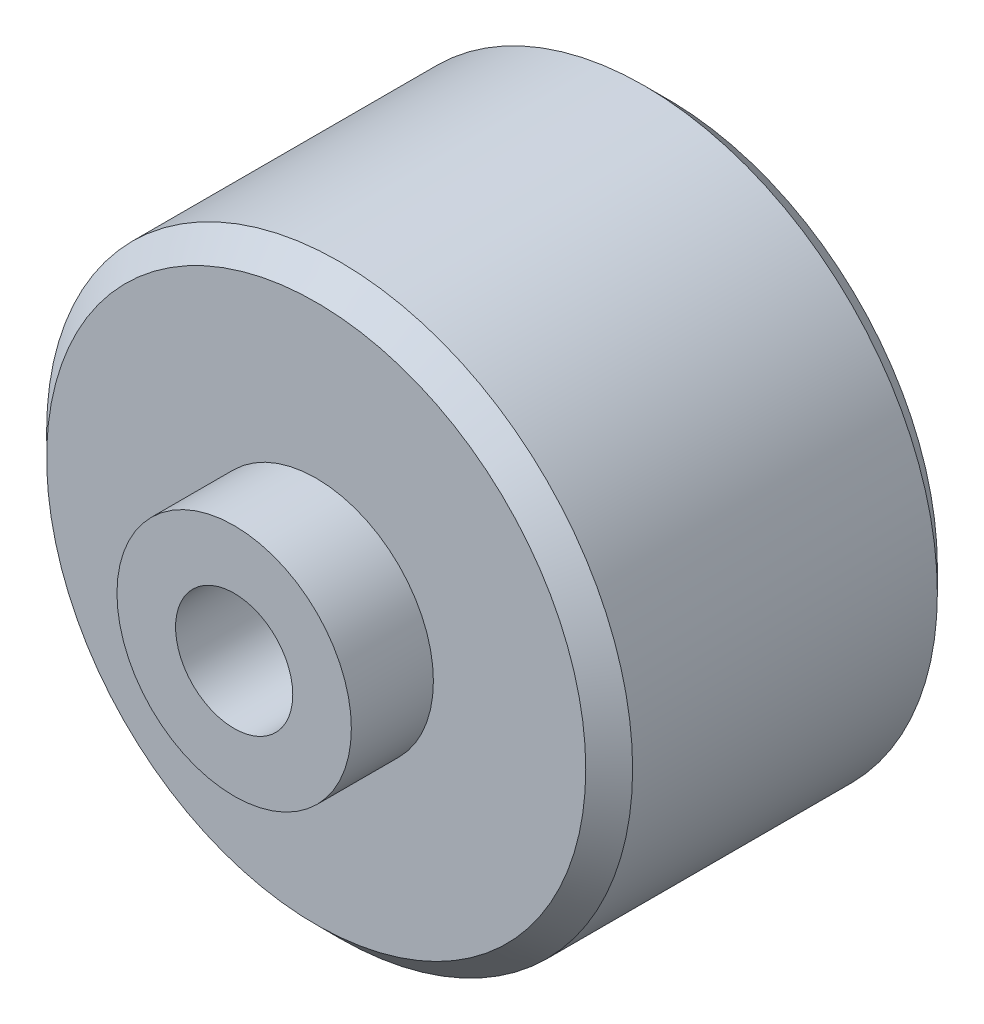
ISO-10303-21;
HEADER;
FILE_DESCRIPTION(('STEP AP214'),'2;1');
FILE_NAME('part.step','',(''),(''),'','','');
FILE_SCHEMA(('AUTOMOTIVE_DESIGN { 1 0 10303 214 1 1 1 1 }'));
ENDSEC;
DATA;
#1=APPLICATION_CONTEXT('core data for automotive mechanical design processes');
#2=APPLICATION_PROTOCOL_DEFINITION('international standard','automotive_design',2000,#1);
#3=PRODUCT_CONTEXT('',#1,'mechanical');
#4=PRODUCT('Part','Part','',(#3));
#5=PRODUCT_RELATED_PRODUCT_CATEGORY('part','',(#4));
#6=PRODUCT_DEFINITION_FORMATION('','',#4);
#7=PRODUCT_DEFINITION_CONTEXT('part definition',#1,'design');
#8=PRODUCT_DEFINITION('design','',#6,#7);
#9=PRODUCT_DEFINITION_SHAPE('','',#8);
#10=(LENGTH_UNIT() NAMED_UNIT(*) SI_UNIT(.MILLI.,.METRE.));
#11=(NAMED_UNIT(*) PLANE_ANGLE_UNIT() SI_UNIT($,.RADIAN.));
#12=(NAMED_UNIT(*) SI_UNIT($,.STERADIAN.) SOLID_ANGLE_UNIT());
#13=UNCERTAINTY_MEASURE_WITH_UNIT(LENGTH_MEASURE(1.E-05),#10,'distance_accuracy_value','');
#14=(GEOMETRIC_REPRESENTATION_CONTEXT(3) GLOBAL_UNCERTAINTY_ASSIGNED_CONTEXT((#13)) GLOBAL_UNIT_ASSIGNED_CONTEXT((#10,
#11,#12)) REPRESENTATION_CONTEXT('',''));
#15=CARTESIAN_POINT('',(0.,0.,0.));
#16=DIRECTION('',(0.,0.,1.));
#17=DIRECTION('',(1.,0.,0.));
#18=AXIS2_PLACEMENT_3D('',#15,#16,#17);
#19=CARTESIAN_POINT('',(0.,0.,15.));
#20=DIRECTION('',(0.,0.,1.));
#21=DIRECTION('',(1.,0.,0.));
#22=AXIS2_PLACEMENT_3D('',#19,#20,#21);
#23=PLANE('',#22);
#24=CARTESIAN_POINT('',(0.,0.,15.));
#25=DIRECTION('',(0.,0.,1.));
#26=DIRECTION('',(1.,0.,0.));
#27=AXIS2_PLACEMENT_3D('',#24,#25,#26);
#28=CIRCLE('',#27,11.5);
#29=CARTESIAN_POINT('',(11.5,0.,15.));
#30=VERTEX_POINT('',#29);
#31=EDGE_CURVE('E10',#30,#30,#28,.T.);
#32=ORIENTED_EDGE('',*,*,#31,.T.);
#33=EDGE_LOOP('',(#32));
#34=FACE_BOUND('',#33,.T.);
#35=CARTESIAN_POINT('',(0.,0.,15.));
#36=DIRECTION('',(0.,0.,1.));
#37=DIRECTION('',(1.,0.,0.));
#38=AXIS2_PLACEMENT_3D('',#35,#36,#37);
#39=CIRCLE('',#38,5.);
#40=CARTESIAN_POINT('',(5.,0.,15.));
#41=VERTEX_POINT('',#40);
#42=EDGE_CURVE('E52',#41,#41,#39,.T.);
#43=ORIENTED_EDGE('',*,*,#42,.F.);
#44=EDGE_LOOP('',(#43));
#45=FACE_BOUND('',#44,.T.);
#46=ADVANCED_FACE('F31',(#34,#45),#23,.T.);
#47=CARTESIAN_POINT('',(0.,0.,15.));
#48=DIRECTION('',(0.,0.,-1.));
#49=DIRECTION('',(-1.,0.,0.));
#50=AXIS2_PLACEMENT_3D('',#47,#48,#49);
#51=CYLINDRICAL_SURFACE('',#50,12.5);
#52=CARTESIAN_POINT('',(0.,0.,0.999999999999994));
#53=DIRECTION('',(0.,0.,1.));
#54=DIRECTION('',(1.,0.,0.));
#55=AXIS2_PLACEMENT_3D('',#52,#53,#54);
#56=CIRCLE('',#55,12.5);
#57=CARTESIAN_POINT('',(12.5,0.,0.999999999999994));
#58=VERTEX_POINT('',#57);
#59=EDGE_CURVE('E42',#58,#58,#56,.T.);
#60=ORIENTED_EDGE('',*,*,#59,.T.);
#61=EDGE_LOOP('',(#60));
#62=FACE_BOUND('',#61,.T.);
#63=CARTESIAN_POINT('',(0.,0.,14.));
#64=DIRECTION('',(0.,0.,1.));
#65=DIRECTION('',(1.,0.,0.));
#66=AXIS2_PLACEMENT_3D('',#63,#64,#65);
#67=CIRCLE('',#66,12.5);
#68=CARTESIAN_POINT('',(12.5,0.,14.));
#69=VERTEX_POINT('',#68);
#70=EDGE_CURVE('E46',#69,#69,#67,.F.);
#71=ORIENTED_EDGE('',*,*,#70,.T.);
#72=EDGE_LOOP('',(#71));
#73=FACE_BOUND('',#72,.T.);
#74=ADVANCED_FACE('F86',(#62,#73),#51,.T.);
#75=CARTESIAN_POINT('',(0.,0.,0.));
#76=DIRECTION('',(0.,0.,1.));
#77=DIRECTION('',(1.,0.,0.));
#78=AXIS2_PLACEMENT_3D('',#75,#76,#77);
#79=PLANE('',#78);
#80=CARTESIAN_POINT('',(0.,0.,0.));
#81=DIRECTION('',(0.,0.,1.));
#82=DIRECTION('',(1.,0.,0.));
#83=AXIS2_PLACEMENT_3D('',#80,#81,#82);
#84=CIRCLE('',#83,11.5);
#85=CARTESIAN_POINT('',(11.5,0.,0.));
#86=VERTEX_POINT('',#85);
#87=EDGE_CURVE('E38',#86,#86,#84,.F.);
#88=ORIENTED_EDGE('',*,*,#87,.T.);
#89=EDGE_LOOP('',(#88));
#90=FACE_BOUND('',#89,.T.);
#91=CARTESIAN_POINT('',(0.,0.,0.));
#92=DIRECTION('',(0.,0.,1.));
#93=DIRECTION('',(1.,0.,0.));
#94=AXIS2_PLACEMENT_3D('',#91,#92,#93);
#95=CIRCLE('',#94,2.5);
#96=CARTESIAN_POINT('',(2.5,0.,0.));
#97=VERTEX_POINT('',#96);
#98=EDGE_CURVE('E55',#97,#97,#95,.T.);
#99=ORIENTED_EDGE('',*,*,#98,.T.);
#100=EDGE_LOOP('',(#99));
#101=FACE_BOUND('',#100,.T.);
#102=ADVANCED_FACE('F64',(#90,#101),#79,.F.);
#103=CARTESIAN_POINT('',(0.,0.,18.5));
#104=DIRECTION('',(0.,0.,-1.));
#105=DIRECTION('',(-1.,0.,0.));
#106=AXIS2_PLACEMENT_3D('',#103,#104,#105);
#107=CYLINDRICAL_SURFACE('',#106,5.);
#108=CARTESIAN_POINT('',(0.,0.,18.5));
#109=DIRECTION('',(0.,0.,1.));
#110=DIRECTION('',(1.,0.,0.));
#111=AXIS2_PLACEMENT_3D('',#108,#109,#110);
#112=CIRCLE('',#111,5.);
#113=CARTESIAN_POINT('',(5.,0.,18.5));
#114=VERTEX_POINT('',#113);
#115=EDGE_CURVE('E51',#114,#114,#112,.T.);
#116=ORIENTED_EDGE('',*,*,#115,.F.);
#117=EDGE_LOOP('',(#116));
#118=FACE_BOUND('',#117,.T.);
#119=ORIENTED_EDGE('',*,*,#42,.T.);
#120=EDGE_LOOP('',(#119));
#121=FACE_BOUND('',#120,.T.);
#122=ADVANCED_FACE('F76',(#118,#121),#107,.T.);
#123=CARTESIAN_POINT('',(0.,0.,18.5));
#124=DIRECTION('',(0.,0.,1.));
#125=DIRECTION('',(1.,0.,0.));
#126=AXIS2_PLACEMENT_3D('',#123,#124,#125);
#127=PLANE('',#126);
#128=CARTESIAN_POINT('',(0.,0.,18.5));
#129=DIRECTION('',(0.,0.,1.));
#130=DIRECTION('',(1.,0.,0.));
#131=AXIS2_PLACEMENT_3D('',#128,#129,#130);
#132=CIRCLE('',#131,2.5);
#133=CARTESIAN_POINT('',(2.5,0.,18.5));
#134=VERTEX_POINT('',#133);
#135=EDGE_CURVE('E58',#134,#134,#132,.T.);
#136=ORIENTED_EDGE('',*,*,#135,.F.);
#137=EDGE_LOOP('',(#136));
#138=FACE_BOUND('',#137,.T.);
#139=ORIENTED_EDGE('',*,*,#115,.T.);
#140=EDGE_LOOP('',(#139));
#141=FACE_BOUND('',#140,.T.);
#142=ADVANCED_FACE('F70',(#138,#141),#127,.T.);
#143=CARTESIAN_POINT('',(0.,0.,0.));
#144=DIRECTION('',(0.,0.,1.));
#145=DIRECTION('',(1.,0.,0.));
#146=AXIS2_PLACEMENT_3D('',#143,#144,#145);
#147=CYLINDRICAL_SURFACE('',#146,2.5);
#148=ORIENTED_EDGE('',*,*,#98,.F.);
#149=EDGE_LOOP('',(#148));
#150=FACE_BOUND('',#149,.T.);
#151=ORIENTED_EDGE('',*,*,#135,.T.);
#152=EDGE_LOOP('',(#151));
#153=FACE_BOUND('',#152,.T.);
#154=ADVANCED_FACE('F66',(#150,#153),#147,.F.);
#155=CARTESIAN_POINT('',(0.,0.,0.999999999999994));
#156=DIRECTION('',(0.,0.,1.));
#157=DIRECTION('',(1.,0.,0.));
#158=AXIS2_PLACEMENT_3D('',#155,#156,#157);
#159=CONICAL_SURFACE('',#158,12.5,0.785398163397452);
#160=ORIENTED_EDGE('',*,*,#87,.F.);
#161=EDGE_LOOP('',(#160));
#162=FACE_BOUND('',#161,.T.);
#163=ORIENTED_EDGE('',*,*,#59,.F.);
#164=EDGE_LOOP('',(#163));
#165=FACE_BOUND('',#164,.T.);
#166=ADVANCED_FACE('F69',(#162,#165),#159,.T.);
#167=CARTESIAN_POINT('',(0.,0.,15.));
#168=DIRECTION('',(0.,0.,-1.));
#169=DIRECTION('',(-1.,0.,0.));
#170=AXIS2_PLACEMENT_3D('',#167,#168,#169);
#171=CONICAL_SURFACE('',#170,11.5,0.785398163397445);
#172=ORIENTED_EDGE('',*,*,#70,.F.);
#173=EDGE_LOOP('',(#172));
#174=FACE_BOUND('',#173,.T.);
#175=ORIENTED_EDGE('',*,*,#31,.F.);
#176=EDGE_LOOP('',(#175));
#177=FACE_BOUND('',#176,.T.);
#178=ADVANCED_FACE('F33',(#174,#177),#171,.T.);
#179=CLOSED_SHELL('',(#46,#74,#102,#122,#142,#154,#166,#178));
#180=MANIFOLD_SOLID_BREP('B2',#179);
#181=ADVANCED_BREP_SHAPE_REPRESENTATION('',(#18,#180),#14);
#182=SHAPE_DEFINITION_REPRESENTATION(#9,#181);
ENDSEC;
END-ISO-10303-21;
